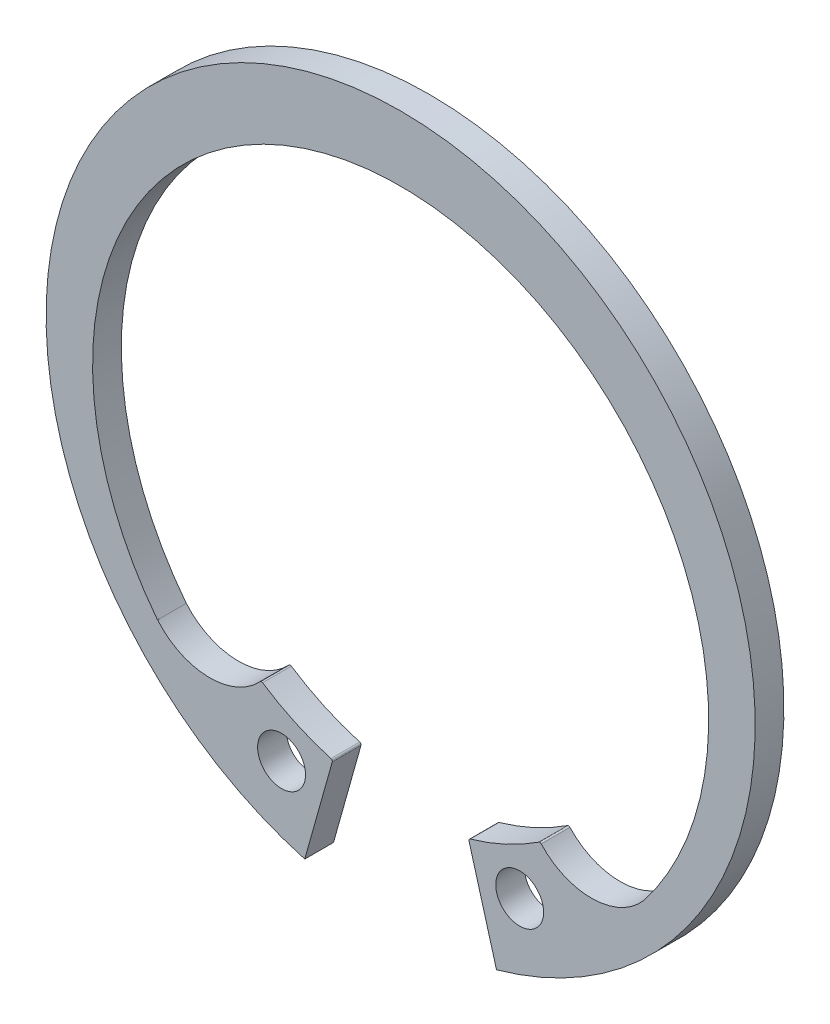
from build123d import *

# Parameters (mm, degrees)
BODYSKE_R    = 1.25
BODY_DEPTH   = 1.5
MODLUGSKE_R  = 1.25
MODLUG_DEPTH = 1.5


with BuildPart() as part:
    # BodySke → Body (new body)
    with BuildSketch(Plane.XY):
        with BuildLine():
            Line((5.002747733, -17.810741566), (4.094412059, -14.576892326))
            ThreePointArc((4.094412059, -14.576892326), (5.161285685, -12.049340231), (7.862830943, -12.527244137))
            ThreePointArc((7.862830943, -12.527244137), (9.411204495, -13.270150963), (11.021741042, -12.673876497))
            ThreePointArc((11.021741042, -12.673876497), (0, 15.1), (-11.021741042, -12.673876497))
            ThreePointArc((-11.021741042, -12.673876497), (-9.411204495, -13.270150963), (-7.862830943, -12.527244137))
            ThreePointArc((-7.862830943, -12.527244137), (-5.161285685, -12.049340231), (-4.094412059, -14.576892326))
            Line((-4.094412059, -14.576892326), (-5.002747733, -17.810741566))
            ThreePointArc((-5.002747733, -17.810741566), (0, 18.5), (5.002747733, -17.810741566))
        make_face()
        with Locations((6.212446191, -13.981970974)):
            Circle(BODYSKE_R, mode=Mode.SUBTRACT)
        with Locations((-6.212446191, -13.981970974)):
            Circle(BODYSKE_R, mode=Mode.SUBTRACT)
    extrude(amount=-BODY_DEPTH)

    # ModLugSke → ModLug (add, through all)
    # profile 1 of 2: a face of its own
    with BuildSketch(Plane.XY):
        with BuildLine():
            Line((5.002747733, -17.810741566), (3.56942568, -12.707840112))
            ThreePointArc((3.56942568, -12.707840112), (3.578317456, -12.632174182), (3.637929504, -12.584731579))
            ThreePointArc((3.637929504, -12.584731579), (5.483636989, -11.897046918), (7.205377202, -10.940408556))
            ThreePointArc((7.205377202, -10.940408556), (7.272282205, -10.924633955), (7.333563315, -10.955774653))
            ThreePointArc((7.333563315, -10.955774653), (10.03303939, -12.096768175), (12.68169521, -10.842312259))
            Line((12.68169521, -10.842312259), (14.061418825, -12.021917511))
            ThreePointArc((14.061418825, -12.021917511), (9.961838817, -15.588834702), (5.002747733, -17.810741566))
        make_face()
        with Locations((6.212446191, -13.981970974)):
            Circle(MODLUGSKE_R, mode=Mode.SUBTRACT)
    # profile 2 of 2: a face of its own
    with BuildSketch(Plane.XY):
        with BuildLine():
            Line((-5.002747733, -17.810741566), (-3.56942568, -12.707840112))
            ThreePointArc((-3.56942568, -12.707840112), (-3.578317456, -12.632174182), (-3.637929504, -12.584731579))
            ThreePointArc((-3.637929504, -12.584731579), (-5.483636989, -11.897046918), (-7.205377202, -10.940408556))
            ThreePointArc((-7.205377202, -10.940408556), (-7.272282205, -10.924633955), (-7.333563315, -10.955774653))
            ThreePointArc((-7.333563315, -10.955774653), (-10.03303939, -12.096768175), (-12.68169521, -10.842312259))
            Line((-12.68169521, -10.842312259), (-14.061418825, -12.021917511))
            ThreePointArc((-14.061418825, -12.021917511), (-9.961838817, -15.588834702), (-5.002747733, -17.810741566))
        make_face()
        with Locations((-6.212446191, -13.981970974)):
            Circle(MODLUGSKE_R, mode=Mode.SUBTRACT)
    extrude(amount=-MODLUG_DEPTH)


solid = part.part
